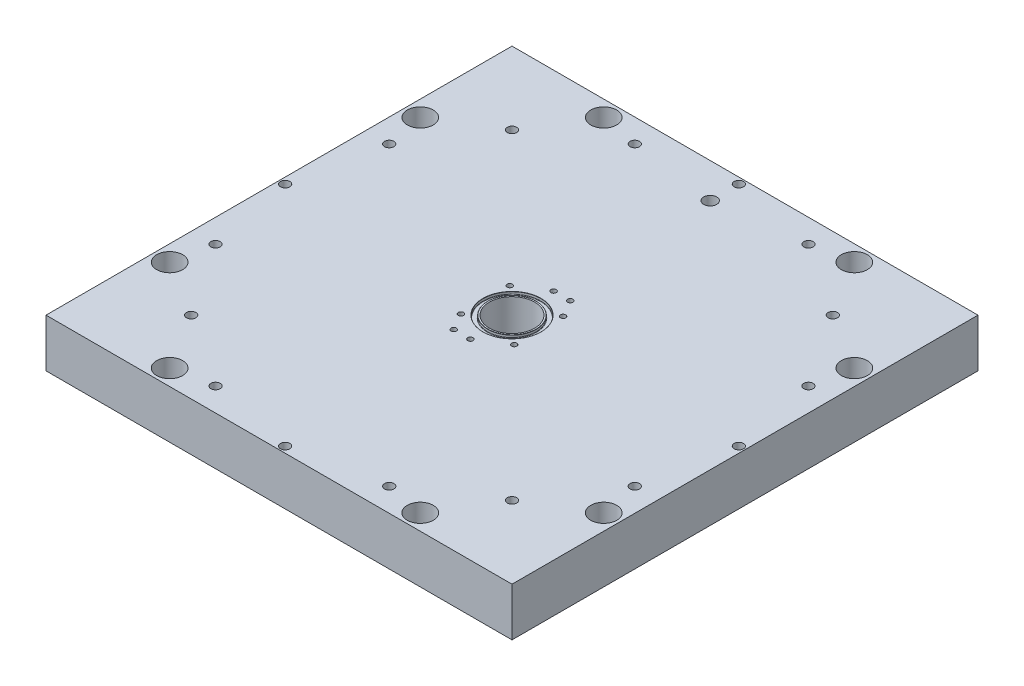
from build123d import *

# Parameters (mm, degrees)
SKETCH1_W                        = 355.6
SKETCH1_H                        = 355.6
SKETCH1_R                        = 17.272
BOSS_EXTRUDE1_DEPTH              = 38.1
F_10_32_TAPPED_HOLE1_D           = 4.0386
F_10_32_TAPPED_HOLE1_DEPTH       = 17.526
F_10_32_TAPPED_HOLE1_TIP         = 1.213317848
F_10_32_TAPPED_HOLE2_D           = 4.0386
F_10_32_TAPPED_HOLE2_DEPTH       = 17.526
F_10_32_TAPPED_HOLE2_TIP         = 1.213317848
SKETCH6_W                        = 381
SKETCH6_H                        = 381
SKETCH6_R                        = 151.27
CUT_EXTRUDE1_DEPTH               = 1.27
FILLET2_R                        = 0.127
F_7_16_20_TAPPED_HOLE2_D         = 9.92124
F_7_16_20_TAPPED_HOLE2_DEPTH     = 50.8
F_7_16_20_TAPPED_HOLE2_TIP       = 2.980641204
F_9_32_0_28125_DIAMETER_HOLE1_D  = 7.14375
CIRPATTERN1_COUNT                = 16
F_25_32_0_78125_DIAMETER_HOLE1_D = 19.84375
CIRPATTERN2_COUNT                = 4


with BuildPart() as part:
    # Sketch1 → Boss-Extrude1 (new body)
    with BuildSketch(Plane(origin=(0, 0, 0), x_dir=(1, 0, 0), z_dir=(0, 1, 0))):
        Rectangle(SKETCH1_W, SKETCH1_H)
        with Locations(Location((0, 0, 0), (0, 0, 90))):
            Circle(SKETCH1_R, mode=Mode.SUBTRACT)
    extrude(amount=BOSS_EXTRUDE1_DEPTH)

    # 10-32 Tapped Hole1
    with Locations(Plane(origin=(0, 38.1, 0), x_dir=(1, 0, 0), z_dir=(0, 1, 0))):
        with Locations((-20.344195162, 18.642630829), (20.29577066, 18.69533777), (20.344195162, -18.642630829), (0, -31.75), (-12.7, -31.75), (-20.29577066, -18.69533777), (0, 31.75), (12.7, 31.75), (0, 0)):
            Hole(F_10_32_TAPPED_HOLE1_D / 2, depth=F_10_32_TAPPED_HOLE1_DEPTH)
            with Locations((0, 0, -(F_10_32_TAPPED_HOLE1_DEPTH + F_10_32_TAPPED_HOLE1_TIP / 2))):  # 118° drill point
                Cone(0, F_10_32_TAPPED_HOLE1_D / 2, F_10_32_TAPPED_HOLE1_TIP, mode=Mode.SUBTRACT)

    # 10-32 Tapped Hole2
    with Locations(Plane(origin=(0, 0, 0), x_dir=(-1, 0, 0), z_dir=(0, -1, 0))):
        with Locations((0, -135), (-51.662263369, -124.723736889), (-95.45941546, -95.45941546), (-124.723736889, -51.662263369), (-135, 0), (-124.723736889, 51.662263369), (-95.45941546, 95.45941546), (-51.662263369, 124.723736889), (0, 135), (51.662263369, 124.723736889), (95.45941546, 95.45941546), (124.723736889, 51.662263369), (135, 0), (124.723736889, -51.662263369), (95.45941546, -95.45941546), (51.662263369, -124.723736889)):
            Hole(F_10_32_TAPPED_HOLE2_D / 2, depth=F_10_32_TAPPED_HOLE2_DEPTH)
            with Locations((0, 0, -(F_10_32_TAPPED_HOLE2_DEPTH + F_10_32_TAPPED_HOLE2_TIP / 2))):  # 118° drill point
                Cone(0, F_10_32_TAPPED_HOLE2_D / 2, F_10_32_TAPPED_HOLE2_TIP, mode=Mode.SUBTRACT)

    # Sketch6 → Cut-Extrude1 (cut)
    with BuildSketch(Plane.XZ):
        Rectangle(SKETCH6_W, SKETCH6_H)
        with Locations(Location((0, 0, 0), (0, 0, 270))):
            Circle(SKETCH6_R, mode=Mode.SUBTRACT)
    extrude(amount=-CUT_EXTRUDE1_DEPTH, mode=Mode.SUBTRACT)

    # Sketch10 → Cut-Revolve1 (revolve, cut)
    with BuildSketch(Plane.XY, mode=Mode.PRIVATE) as cut_revolve1_sk:
        Polygon((-122.54, 0), (0, 10.720860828), (0, -44.996025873), (-122.54, -44.996025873), align=None)
    revolve(cut_revolve1_sk.sketch.rotate(Axis((0, 0, 0), (0, -1, 0)), 90), axis=Axis((0, 0, 0), (0, -1, 0)), mode=Mode.SUBTRACT)

    # Sketch12 → Cut-Revolve2 (revolve, cut)
    with BuildSketch(Plane.XY, mode=Mode.PRIVATE) as cut_revolve2_sk:
        with BuildLine():
            Line((-22.0599, 38.1), (-18.5293, 38.1))
            Line((-18.5293, 38.1), (-18.5293, 36.3982))
            ThreePointArc((-18.5293, 36.3982), (-18.603694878, 36.218594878), (-18.7833, 36.1442))
            Line((-18.7833, 36.1442), (-21.8059, 36.1442))
            ThreePointArc((-21.8059, 36.1442), (-21.985505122, 36.218594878), (-22.0599, 36.3982))
            Line((-22.0599, 36.3982), (-22.0599, 38.1))
        make_face()
    revolve(cut_revolve2_sk.sketch.rotate(Axis((0, 64.233146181, 0), (0, -1, 0)), 270), axis=Axis((0, 64.233146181, 0), (0, -1, 0)), mode=Mode.SUBTRACT)

    # Fillet2
    fillet2_edges = [part.edges().sort_by_distance(p)[0] for p in [
        (0, 38.1, -18.5293),
        (0, 38.1, -22.0599),
    ]]
    fillet(fillet2_edges, radius=FILLET2_R)

    # 7_16-20 Tapped Hole2
    with Locations(Plane(origin=(0, 38.1, 0), x_dir=(1, 0, 0), z_dir=(0, 1, 0))):
        with Locations((0, 151.27)):
            Hole(F_7_16_20_TAPPED_HOLE2_D / 2, depth=F_7_16_20_TAPPED_HOLE2_DEPTH)
            with Locations((0, 0, -(F_7_16_20_TAPPED_HOLE2_DEPTH + F_7_16_20_TAPPED_HOLE2_TIP / 2))):  # 118° drill point
                Cone(0, F_7_16_20_TAPPED_HOLE2_D / 2, F_7_16_20_TAPPED_HOLE2_TIP, mode=Mode.SUBTRACT)

    # 9_32 _0.28125_ Diameter Hole1 (through all)
    with Locations(Plane(origin=(0, 38.1, 0), x_dir=(1, 0, 0), z_dir=(0, 1, 0))):
        with Locations((-122.409871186, 122.409871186)):
            f_9_32_0_28125_diameter_hole1 = Hole(F_9_32_0_28125_DIAMETER_HOLE1_D / 2)

    # CirPattern1: 9_32 _0.28125_ Diameter Hole1 ×16 about axis
    cirpattern1_axis = Axis((0, 0, 0), (0, 1, 0))
    for i in range(1, CIRPATTERN1_COUNT):
        add(f_9_32_0_28125_diameter_hole1.rotate(cirpattern1_axis, i * 360 / CIRPATTERN1_COUNT), mode=Mode.SUBTRACT)

    # 25_32 _0.78125_ Diameter Hole1 (through all)
    with Locations(Plane(origin=(0, 38.1, 0), x_dir=(1, 0, 0), z_dir=(0, 1, 0))):
        with Locations((-95.619945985, -165.618604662), (-165.618604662, -95.619945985)):
            f_25_32_0_78125_diameter_hole1 = Hole(F_25_32_0_78125_DIAMETER_HOLE1_D / 2)

    # CirPattern2: 25_32 _0.78125_ Diameter Hole1 ×4 about axis
    cirpattern2_axis = Axis((0, 0, 0), (0, 1, 0))
    for i in range(1, CIRPATTERN2_COUNT):
        add(f_25_32_0_78125_diameter_hole1.rotate(cirpattern2_axis, i * 360 / CIRPATTERN2_COUNT), mode=Mode.SUBTRACT)


solid = part.part
